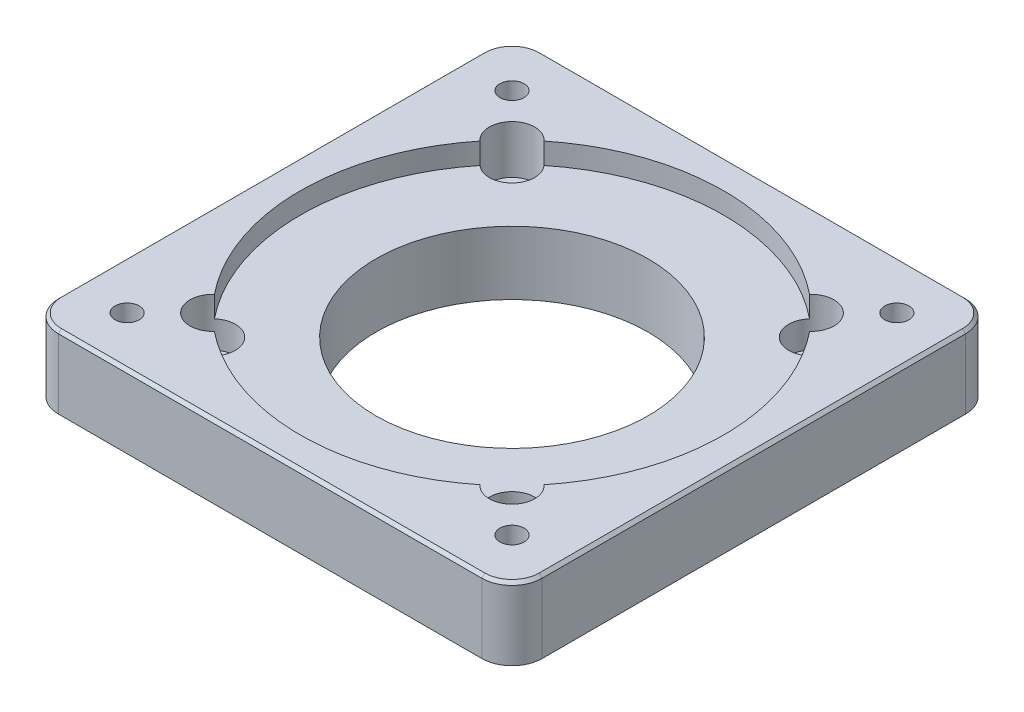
ISO-10303-21;
HEADER;
FILE_DESCRIPTION(('STEP AP214'),'2;1');
FILE_NAME('part.step','',(''),(''),'','','');
FILE_SCHEMA(('AUTOMOTIVE_DESIGN { 1 0 10303 214 1 1 1 1 }'));
ENDSEC;
DATA;
#1=APPLICATION_CONTEXT('core data for automotive mechanical design processes');
#2=APPLICATION_PROTOCOL_DEFINITION('international standard','automotive_design',2000,#1);
#3=PRODUCT_CONTEXT('',#1,'mechanical');
#4=PRODUCT('Part','Part','',(#3));
#5=PRODUCT_RELATED_PRODUCT_CATEGORY('part','',(#4));
#6=PRODUCT_DEFINITION_FORMATION('','',#4);
#7=PRODUCT_DEFINITION_CONTEXT('part definition',#1,'design');
#8=PRODUCT_DEFINITION('design','',#6,#7);
#9=PRODUCT_DEFINITION_SHAPE('','',#8);
#10=(LENGTH_UNIT() NAMED_UNIT(*) SI_UNIT(.MILLI.,.METRE.));
#11=(NAMED_UNIT(*) PLANE_ANGLE_UNIT() SI_UNIT($,.RADIAN.));
#12=(NAMED_UNIT(*) SI_UNIT($,.STERADIAN.) SOLID_ANGLE_UNIT());
#13=UNCERTAINTY_MEASURE_WITH_UNIT(LENGTH_MEASURE(1.E-05),#10,'distance_accuracy_value','');
#14=(GEOMETRIC_REPRESENTATION_CONTEXT(3) GLOBAL_UNCERTAINTY_ASSIGNED_CONTEXT((#13)) GLOBAL_UNIT_ASSIGNED_CONTEXT((#10,
#11,#12)) REPRESENTATION_CONTEXT('',''));
#15=CARTESIAN_POINT('',(0.,0.,0.));
#16=DIRECTION('',(0.,0.,1.));
#17=DIRECTION('',(1.,0.,0.));
#18=AXIS2_PLACEMENT_3D('',#15,#16,#17);
#19=CARTESIAN_POINT('',(0.,0.,0.));
#20=DIRECTION('',(0.,1.,0.));
#21=DIRECTION('',(0.,0.,1.));
#22=AXIS2_PLACEMENT_3D('',#19,#20,#21);
#23=PLANE('',#22);
#24=DIRECTION('',(0.,0.,-1.));
#25=VECTOR('',#24,1.);
#26=CARTESIAN_POINT('',(40.,0.,-40.));
#27=LINE('',#26,#25);
#28=CARTESIAN_POINT('',(40.,0.,35.));
#29=VERTEX_POINT('',#28);
#30=CARTESIAN_POINT('',(40.,0.,-35.));
#31=VERTEX_POINT('',#30);
#32=EDGE_CURVE('E541',#29,#31,#27,.T.);
#33=ORIENTED_EDGE('',*,*,#32,.F.);
#34=CARTESIAN_POINT('',(35.,0.,35.));
#35=DIRECTION('',(0.,1.,0.));
#36=DIRECTION('',(0.,0.,1.));
#37=AXIS2_PLACEMENT_3D('',#34,#35,#36);
#38=CIRCLE('',#37,5.);
#39=CARTESIAN_POINT('',(35.,0.,40.));
#40=VERTEX_POINT('',#39);
#41=EDGE_CURVE('E251',#29,#40,#38,.F.);
#42=ORIENTED_EDGE('',*,*,#41,.T.);
#43=DIRECTION('',(1.,0.,0.));
#44=VECTOR('',#43,1.);
#45=CARTESIAN_POINT('',(-40.,0.,40.));
#46=LINE('',#45,#44);
#47=CARTESIAN_POINT('',(-35.,0.,40.));
#48=VERTEX_POINT('',#47);
#49=EDGE_CURVE('E416',#48,#40,#46,.T.);
#50=ORIENTED_EDGE('',*,*,#49,.F.);
#51=CARTESIAN_POINT('',(-35.,0.,35.));
#52=DIRECTION('',(0.,1.,0.));
#53=DIRECTION('',(0.,0.,1.));
#54=AXIS2_PLACEMENT_3D('',#51,#52,#53);
#55=CIRCLE('',#54,5.);
#56=CARTESIAN_POINT('',(-40.,0.,35.));
#57=VERTEX_POINT('',#56);
#58=EDGE_CURVE('E245',#48,#57,#55,.F.);
#59=ORIENTED_EDGE('',*,*,#58,.T.);
#60=DIRECTION('',(0.,0.,1.));
#61=VECTOR('',#60,1.);
#62=CARTESIAN_POINT('',(-40.,0.,-40.));
#63=LINE('',#62,#61);
#64=CARTESIAN_POINT('',(-40.,0.,-35.));
#65=VERTEX_POINT('',#64);
#66=EDGE_CURVE('E411',#65,#57,#63,.T.);
#67=ORIENTED_EDGE('',*,*,#66,.F.);
#68=CARTESIAN_POINT('',(-35.,0.,-35.));
#69=DIRECTION('',(0.,1.,0.));
#70=DIRECTION('',(0.,0.,1.));
#71=AXIS2_PLACEMENT_3D('',#68,#69,#70);
#72=CIRCLE('',#71,5.);
#73=CARTESIAN_POINT('',(-35.,0.,-40.));
#74=VERTEX_POINT('',#73);
#75=EDGE_CURVE('E247',#65,#74,#72,.F.);
#76=ORIENTED_EDGE('',*,*,#75,.T.);
#77=DIRECTION('',(-1.,0.,0.));
#78=VECTOR('',#77,1.);
#79=CARTESIAN_POINT('',(-40.,0.,-40.));
#80=LINE('',#79,#78);
#81=CARTESIAN_POINT('',(35.,0.,-40.));
#82=VERTEX_POINT('',#81);
#83=EDGE_CURVE('E228',#82,#74,#80,.T.);
#84=ORIENTED_EDGE('',*,*,#83,.F.);
#85=CARTESIAN_POINT('',(35.,0.,-35.));
#86=DIRECTION('',(0.,1.,0.));
#87=DIRECTION('',(0.,0.,1.));
#88=AXIS2_PLACEMENT_3D('',#85,#86,#87);
#89=CIRCLE('',#88,5.);
#90=EDGE_CURVE('E249',#82,#31,#89,.F.);
#91=ORIENTED_EDGE('',*,*,#90,.T.);
#92=EDGE_LOOP('',(#33,#42,#50,#59,#67,#76,#84,#91));
#93=FACE_BOUND('',#92,.T.);
#94=CARTESIAN_POINT('',(24.7487373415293,0.,-24.748737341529));
#95=DIRECTION('',(0.,1.,0.));
#96=DIRECTION('',(0.,0.,1.));
#97=AXIS2_PLACEMENT_3D('',#94,#95,#96);
#98=CIRCLE('',#97,2.25);
#99=CARTESIAN_POINT('',(24.7487373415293,0.,-22.498737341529));
#100=VERTEX_POINT('',#99);
#101=EDGE_CURVE('E403',#100,#100,#98,.T.);
#102=ORIENTED_EDGE('',*,*,#101,.T.);
#103=EDGE_LOOP('',(#102));
#104=FACE_BOUND('',#103,.T.);
#105=CARTESIAN_POINT('',(24.7487373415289,0.,24.7487373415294));
#106=DIRECTION('',(0.,1.,0.));
#107=DIRECTION('',(0.,0.,1.));
#108=AXIS2_PLACEMENT_3D('',#105,#106,#107);
#109=CIRCLE('',#108,2.25);
#110=CARTESIAN_POINT('',(24.7487373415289,0.,26.9987373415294));
#111=VERTEX_POINT('',#110);
#112=EDGE_CURVE('E201',#111,#111,#109,.T.);
#113=ORIENTED_EDGE('',*,*,#112,.T.);
#114=EDGE_LOOP('',(#113));
#115=FACE_BOUND('',#114,.T.);
#116=CARTESIAN_POINT('',(-24.7487373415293,0.,24.748737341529));
#117=DIRECTION('',(0.,1.,0.));
#118=DIRECTION('',(0.,0.,1.));
#119=AXIS2_PLACEMENT_3D('',#116,#117,#118);
#120=CIRCLE('',#119,2.25);
#121=CARTESIAN_POINT('',(-24.7487373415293,0.,26.998737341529));
#122=VERTEX_POINT('',#121);
#123=EDGE_CURVE('E368',#122,#122,#120,.T.);
#124=ORIENTED_EDGE('',*,*,#123,.T.);
#125=EDGE_LOOP('',(#124));
#126=FACE_BOUND('',#125,.T.);
#127=CARTESIAN_POINT('',(-24.7487373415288,0.,-24.7487373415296));
#128=DIRECTION('',(0.,1.,0.));
#129=DIRECTION('',(0.,0.,1.));
#130=AXIS2_PLACEMENT_3D('',#127,#128,#129);
#131=CIRCLE('',#130,2.25);
#132=CARTESIAN_POINT('',(-24.7487373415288,0.,-22.4987373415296));
#133=VERTEX_POINT('',#132);
#134=EDGE_CURVE('E362',#133,#133,#131,.T.);
#135=ORIENTED_EDGE('',*,*,#134,.T.);
#136=EDGE_LOOP('',(#135));
#137=FACE_BOUND('',#136,.T.);
#138=CARTESIAN_POINT('',(-31.8198051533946,0.,-31.8198051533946));
#139=DIRECTION('',(0.,1.,0.));
#140=DIRECTION('',(0.,0.,1.));
#141=AXIS2_PLACEMENT_3D('',#138,#139,#140);
#142=CIRCLE('',#141,2.);
#143=CARTESIAN_POINT('',(-31.8198051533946,0.,-29.8198051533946));
#144=VERTEX_POINT('',#143);
#145=EDGE_CURVE('E354',#144,#144,#142,.T.);
#146=ORIENTED_EDGE('',*,*,#145,.T.);
#147=EDGE_LOOP('',(#146));
#148=FACE_BOUND('',#147,.T.);
#149=CARTESIAN_POINT('',(31.8198051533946,0.,-31.8198051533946));
#150=DIRECTION('',(0.,1.,0.));
#151=DIRECTION('',(0.,0.,1.));
#152=AXIS2_PLACEMENT_3D('',#149,#150,#151);
#153=CIRCLE('',#152,2.);
#154=CARTESIAN_POINT('',(31.8198051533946,0.,-29.8198051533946));
#155=VERTEX_POINT('',#154);
#156=EDGE_CURVE('E348',#155,#155,#153,.T.);
#157=ORIENTED_EDGE('',*,*,#156,.T.);
#158=EDGE_LOOP('',(#157));
#159=FACE_BOUND('',#158,.T.);
#160=CARTESIAN_POINT('',(31.8198051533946,0.,31.8198051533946));
#161=DIRECTION('',(0.,1.,0.));
#162=DIRECTION('',(0.,0.,1.));
#163=AXIS2_PLACEMENT_3D('',#160,#161,#162);
#164=CIRCLE('',#163,2.);
#165=CARTESIAN_POINT('',(31.8198051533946,0.,33.8198051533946));
#166=VERTEX_POINT('',#165);
#167=EDGE_CURVE('E342',#166,#166,#164,.T.);
#168=ORIENTED_EDGE('',*,*,#167,.T.);
#169=EDGE_LOOP('',(#168));
#170=FACE_BOUND('',#169,.T.);
#171=CARTESIAN_POINT('',(-31.8198051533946,0.,31.8198051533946));
#172=DIRECTION('',(0.,1.,0.));
#173=DIRECTION('',(0.,0.,1.));
#174=AXIS2_PLACEMENT_3D('',#171,#172,#173);
#175=CIRCLE('',#174,2.);
#176=CARTESIAN_POINT('',(-31.8198051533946,0.,33.8198051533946));
#177=VERTEX_POINT('',#176);
#178=EDGE_CURVE('E336',#177,#177,#175,.T.);
#179=ORIENTED_EDGE('',*,*,#178,.T.);
#180=EDGE_LOOP('',(#179));
#181=FACE_BOUND('',#180,.T.);
#182=CARTESIAN_POINT('',(0.,0.,0.));
#183=DIRECTION('',(0.,1.,0.));
#184=DIRECTION('',(0.,0.,1.));
#185=AXIS2_PLACEMENT_3D('',#182,#183,#184);
#186=CIRCLE('',#185,25.);
#187=CARTESIAN_POINT('',(0.,0.,25.));
#188=VERTEX_POINT('',#187);
#189=EDGE_CURVE('E267',#188,#188,#186,.F.);
#190=ORIENTED_EDGE('',*,*,#189,.F.);
#191=EDGE_LOOP('',(#190));
#192=FACE_BOUND('',#191,.T.);
#193=ADVANCED_FACE('F42',(#93,#104,#115,#126,#137,#148,#159,#170,#181,#192),#23,.F.);
#194=CARTESIAN_POINT('',(0.,8.5,0.));
#195=DIRECTION('',(0.,1.,0.));
#196=DIRECTION('',(0.,0.,1.));
#197=AXIS2_PLACEMENT_3D('',#194,#195,#196);
#198=CYLINDRICAL_SURFACE('',#197,35.);
#199=CARTESIAN_POINT('',(0.,8.5,0.));
#200=DIRECTION('',(0.,1.,0.));
#201=DIRECTION('',(0.,0.,1.));
#202=AXIS2_PLACEMENT_3D('',#199,#200,#201);
#203=CIRCLE('',#202,35.);
#204=CARTESIAN_POINT('',(-27.25452735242,8.5,-21.9588419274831));
#205=VERTEX_POINT('',#204);
#206=CARTESIAN_POINT('',(-27.2545273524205,8.5,21.9588419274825));
#207=VERTEX_POINT('',#206);
#208=EDGE_CURVE('E412',#205,#207,#203,.T.);
#209=ORIENTED_EDGE('',*,*,#208,.F.);
#210=DIRECTION('',(0.,1.,0.));
#211=VECTOR('',#210,1.);
#212=CARTESIAN_POINT('',(-27.25452735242,8.,-21.9588419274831));
#213=LINE('',#212,#211);
#214=CARTESIAN_POINT('',(-27.25452735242,12.,-21.9588419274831));
#215=VERTEX_POINT('',#214);
#216=EDGE_CURVE('E190',#205,#215,#213,.T.);
#217=ORIENTED_EDGE('',*,*,#216,.T.);
#218=CARTESIAN_POINT('',(0.,12.,0.));
#219=DIRECTION('',(0.,1.,0.));
#220=DIRECTION('',(0.,0.,1.));
#221=AXIS2_PLACEMENT_3D('',#218,#219,#220);
#222=CIRCLE('',#221,35.);
#223=CARTESIAN_POINT('',(-27.2545273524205,12.,21.9588419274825));
#224=VERTEX_POINT('',#223);
#225=EDGE_CURVE('E200',#215,#224,#222,.T.);
#226=ORIENTED_EDGE('',*,*,#225,.T.);
#227=DIRECTION('',(0.,1.,0.));
#228=VECTOR('',#227,1.);
#229=CARTESIAN_POINT('',(-27.2545273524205,8.,21.9588419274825));
#230=LINE('',#229,#228);
#231=EDGE_CURVE('E383',#224,#207,#230,.F.);
#232=ORIENTED_EDGE('',*,*,#231,.T.);
#233=EDGE_LOOP('',(#209,#217,#226,#232));
#234=FACE_BOUND('',#233,.T.);
#235=ADVANCED_FACE('F449',(#234),#198,.F.);
#236=CARTESIAN_POINT('',(-21.9588419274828,8.5,27.2545273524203));
#237=VERTEX_POINT('',#236);
#238=CARTESIAN_POINT('',(21.9588419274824,8.5,27.2545273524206));
#239=VERTEX_POINT('',#238);
#240=EDGE_CURVE('E209',#237,#239,#203,.T.);
#241=ORIENTED_EDGE('',*,*,#240,.F.);
#242=DIRECTION('',(0.,1.,0.));
#243=VECTOR('',#242,1.);
#244=CARTESIAN_POINT('',(-21.9588419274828,8.,27.2545273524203));
#245=LINE('',#244,#243);
#246=CARTESIAN_POINT('',(-21.9588419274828,12.,27.2545273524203));
#247=VERTEX_POINT('',#246);
#248=EDGE_CURVE('E387',#237,#247,#245,.T.);
#249=ORIENTED_EDGE('',*,*,#248,.T.);
#250=CARTESIAN_POINT('',(21.9588419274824,12.,27.2545273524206));
#251=VERTEX_POINT('',#250);
#252=EDGE_CURVE('E212',#247,#251,#222,.T.);
#253=ORIENTED_EDGE('',*,*,#252,.T.);
#254=DIRECTION('',(0.,1.,0.));
#255=VECTOR('',#254,1.);
#256=CARTESIAN_POINT('',(21.9588419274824,8.,27.2545273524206));
#257=LINE('',#256,#255);
#258=EDGE_CURVE('E394',#251,#239,#257,.F.);
#259=ORIENTED_EDGE('',*,*,#258,.T.);
#260=EDGE_LOOP('',(#241,#249,#253,#259));
#261=FACE_BOUND('',#260,.T.);
#262=ADVANCED_FACE('F429',(#261),#198,.F.);
#263=CARTESIAN_POINT('',(27.2545273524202,8.5,21.9588419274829));
#264=VERTEX_POINT('',#263);
#265=CARTESIAN_POINT('',(27.2545273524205,8.5,-21.9588419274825));
#266=VERTEX_POINT('',#265);
#267=EDGE_CURVE('E206',#264,#266,#203,.T.);
#268=ORIENTED_EDGE('',*,*,#267,.F.);
#269=DIRECTION('',(0.,1.,0.));
#270=VECTOR('',#269,1.);
#271=CARTESIAN_POINT('',(27.2545273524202,8.,21.9588419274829));
#272=LINE('',#271,#270);
#273=CARTESIAN_POINT('',(27.2545273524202,12.,21.9588419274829));
#274=VERTEX_POINT('',#273);
#275=EDGE_CURVE('E398',#264,#274,#272,.T.);
#276=ORIENTED_EDGE('',*,*,#275,.T.);
#277=CARTESIAN_POINT('',(27.2545273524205,12.,-21.9588419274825));
#278=VERTEX_POINT('',#277);
#279=EDGE_CURVE('E208',#274,#278,#222,.T.);
#280=ORIENTED_EDGE('',*,*,#279,.T.);
#281=DIRECTION('',(0.,1.,0.));
#282=VECTOR('',#281,1.);
#283=CARTESIAN_POINT('',(27.2545273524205,8.,-21.9588419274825));
#284=LINE('',#283,#282);
#285=EDGE_CURVE('E224',#278,#266,#284,.F.);
#286=ORIENTED_EDGE('',*,*,#285,.T.);
#287=EDGE_LOOP('',(#268,#276,#280,#286));
#288=FACE_BOUND('',#287,.T.);
#289=ADVANCED_FACE('F431',(#288),#198,.F.);
#290=CARTESIAN_POINT('',(-40.,12.,-40.));
#291=DIRECTION('',(1.,0.,0.));
#292=DIRECTION('',(0.,0.,-1.));
#293=AXIS2_PLACEMENT_3D('',#290,#291,#292);
#294=PLANE('',#293);
#295=DIRECTION('',(0.,-1.,0.));
#296=VECTOR('',#295,1.);
#297=CARTESIAN_POINT('',(-40.,12.,35.));
#298=LINE('',#297,#296);
#299=CARTESIAN_POINT('',(-40.,11.5,35.));
#300=VERTEX_POINT('',#299);
#301=EDGE_CURVE('E262',#57,#300,#298,.F.);
#302=ORIENTED_EDGE('',*,*,#301,.T.);
#303=DIRECTION('',(0.,0.,-1.));
#304=VECTOR('',#303,1.);
#305=CARTESIAN_POINT('',(-40.,11.5,-35.));
#306=LINE('',#305,#304);
#307=CARTESIAN_POINT('',(-40.,11.5,-35.));
#308=VERTEX_POINT('',#307);
#309=EDGE_CURVE('E294',#300,#308,#306,.T.);
#310=ORIENTED_EDGE('',*,*,#309,.T.);
#311=DIRECTION('',(0.,-1.,0.));
#312=VECTOR('',#311,1.);
#313=CARTESIAN_POINT('',(-40.,12.,-35.));
#314=LINE('',#313,#312);
#315=EDGE_CURVE('E265',#308,#65,#314,.T.);
#316=ORIENTED_EDGE('',*,*,#315,.T.);
#317=ORIENTED_EDGE('',*,*,#66,.T.);
#318=EDGE_LOOP('',(#302,#310,#316,#317));
#319=FACE_BOUND('',#318,.T.);
#320=ADVANCED_FACE('F472',(#319),#294,.F.);
#321=CARTESIAN_POINT('',(-40.,12.,40.));
#322=DIRECTION('',(0.,0.,-1.));
#323=DIRECTION('',(-1.,0.,0.));
#324=AXIS2_PLACEMENT_3D('',#321,#322,#323);
#325=PLANE('',#324);
#326=DIRECTION('',(0.,-1.,0.));
#327=VECTOR('',#326,1.);
#328=CARTESIAN_POINT('',(35.,12.,40.));
#329=LINE('',#328,#327);
#330=CARTESIAN_POINT('',(35.,11.5,40.));
#331=VERTEX_POINT('',#330);
#332=EDGE_CURVE('E255',#40,#331,#329,.F.);
#333=ORIENTED_EDGE('',*,*,#332,.T.);
#334=DIRECTION('',(-1.,0.,0.));
#335=VECTOR('',#334,1.);
#336=CARTESIAN_POINT('',(-35.,11.5,40.));
#337=LINE('',#336,#335);
#338=CARTESIAN_POINT('',(-35.,11.5,40.));
#339=VERTEX_POINT('',#338);
#340=EDGE_CURVE('E12',#331,#339,#337,.T.);
#341=ORIENTED_EDGE('',*,*,#340,.T.);
#342=DIRECTION('',(0.,-1.,0.));
#343=VECTOR('',#342,1.);
#344=CARTESIAN_POINT('',(-35.,12.,40.));
#345=LINE('',#344,#343);
#346=EDGE_CURVE('E253',#339,#48,#345,.T.);
#347=ORIENTED_EDGE('',*,*,#346,.T.);
#348=ORIENTED_EDGE('',*,*,#49,.T.);
#349=EDGE_LOOP('',(#333,#341,#347,#348));
#350=FACE_BOUND('',#349,.T.);
#351=ADVANCED_FACE('F468',(#350),#325,.F.);
#352=CARTESIAN_POINT('',(40.,12.,-40.));
#353=DIRECTION('',(-1.,0.,0.));
#354=DIRECTION('',(0.,0.,1.));
#355=AXIS2_PLACEMENT_3D('',#352,#353,#354);
#356=PLANE('',#355);
#357=DIRECTION('',(0.,-1.,0.));
#358=VECTOR('',#357,1.);
#359=CARTESIAN_POINT('',(40.,12.,-35.));
#360=LINE('',#359,#358);
#361=CARTESIAN_POINT('',(40.,11.5,-35.));
#362=VERTEX_POINT('',#361);
#363=EDGE_CURVE('E240',#31,#362,#360,.F.);
#364=ORIENTED_EDGE('',*,*,#363,.T.);
#365=DIRECTION('',(0.,0.,1.));
#366=VECTOR('',#365,1.);
#367=CARTESIAN_POINT('',(40.,11.5,35.));
#368=LINE('',#367,#366);
#369=CARTESIAN_POINT('',(40.,11.5,35.));
#370=VERTEX_POINT('',#369);
#371=EDGE_CURVE('E296',#362,#370,#368,.T.);
#372=ORIENTED_EDGE('',*,*,#371,.T.);
#373=DIRECTION('',(0.,-1.,0.));
#374=VECTOR('',#373,1.);
#375=CARTESIAN_POINT('',(40.,12.,35.));
#376=LINE('',#375,#374);
#377=EDGE_CURVE('E243',#370,#29,#376,.T.);
#378=ORIENTED_EDGE('',*,*,#377,.T.);
#379=ORIENTED_EDGE('',*,*,#32,.T.);
#380=EDGE_LOOP('',(#364,#372,#378,#379));
#381=FACE_BOUND('',#380,.T.);
#382=ADVANCED_FACE('F464',(#381),#356,.F.);
#383=CARTESIAN_POINT('',(-40.,12.,-40.));
#384=DIRECTION('',(0.,0.,1.));
#385=DIRECTION('',(1.,0.,0.));
#386=AXIS2_PLACEMENT_3D('',#383,#384,#385);
#387=PLANE('',#386);
#388=DIRECTION('',(0.,-1.,0.));
#389=VECTOR('',#388,1.);
#390=CARTESIAN_POINT('',(-35.,12.,-40.));
#391=LINE('',#390,#389);
#392=CARTESIAN_POINT('',(-35.,11.5,-40.));
#393=VERTEX_POINT('',#392);
#394=EDGE_CURVE('E257',#74,#393,#391,.F.);
#395=ORIENTED_EDGE('',*,*,#394,.T.);
#396=DIRECTION('',(1.,0.,0.));
#397=VECTOR('',#396,1.);
#398=CARTESIAN_POINT('',(35.,11.5,-40.));
#399=LINE('',#398,#397);
#400=CARTESIAN_POINT('',(35.,11.5,-40.));
#401=VERTEX_POINT('',#400);
#402=EDGE_CURVE('E287',#393,#401,#399,.T.);
#403=ORIENTED_EDGE('',*,*,#402,.T.);
#404=DIRECTION('',(0.,-1.,0.));
#405=VECTOR('',#404,1.);
#406=CARTESIAN_POINT('',(35.,12.,-40.));
#407=LINE('',#406,#405);
#408=EDGE_CURVE('E260',#401,#82,#407,.T.);
#409=ORIENTED_EDGE('',*,*,#408,.T.);
#410=ORIENTED_EDGE('',*,*,#83,.T.);
#411=EDGE_LOOP('',(#395,#403,#409,#410));
#412=FACE_BOUND('',#411,.T.);
#413=ADVANCED_FACE('F461',(#412),#387,.F.);
#414=CARTESIAN_POINT('',(0.,12.,0.));
#415=DIRECTION('',(0.,1.,0.));
#416=DIRECTION('',(0.,0.,1.));
#417=AXIS2_PLACEMENT_3D('',#414,#415,#416);
#418=PLANE('',#417);
#419=CARTESIAN_POINT('',(35.,12.,-35.));
#420=DIRECTION('',(0.,1.,0.));
#421=DIRECTION('',(0.,0.,1.));
#422=AXIS2_PLACEMENT_3D('',#419,#420,#421);
#423=CIRCLE('',#422,4.5);
#424=CARTESIAN_POINT('',(39.5,12.,-35.));
#425=VERTEX_POINT('',#424);
#426=CARTESIAN_POINT('',(35.,12.,-39.5));
#427=VERTEX_POINT('',#426);
#428=EDGE_CURVE('E280',#425,#427,#423,.T.);
#429=ORIENTED_EDGE('',*,*,#428,.T.);
#430=DIRECTION('',(-1.,0.,0.));
#431=VECTOR('',#430,1.);
#432=CARTESIAN_POINT('',(-35.,12.,-39.5));
#433=LINE('',#432,#431);
#434=CARTESIAN_POINT('',(-35.,12.,-39.5));
#435=VERTEX_POINT('',#434);
#436=EDGE_CURVE('E284',#427,#435,#433,.T.);
#437=ORIENTED_EDGE('',*,*,#436,.T.);
#438=CARTESIAN_POINT('',(-35.,12.,-35.));
#439=DIRECTION('',(0.,1.,0.));
#440=DIRECTION('',(0.,0.,1.));
#441=AXIS2_PLACEMENT_3D('',#438,#439,#440);
#442=CIRCLE('',#441,4.5);
#443=CARTESIAN_POINT('',(-39.5,12.,-35.));
#444=VERTEX_POINT('',#443);
#445=EDGE_CURVE('E282',#435,#444,#442,.T.);
#446=ORIENTED_EDGE('',*,*,#445,.T.);
#447=DIRECTION('',(0.,0.,1.));
#448=VECTOR('',#447,1.);
#449=CARTESIAN_POINT('',(-39.5,12.,35.));
#450=LINE('',#449,#448);
#451=CARTESIAN_POINT('',(-39.5,12.,35.));
#452=VERTEX_POINT('',#451);
#453=EDGE_CURVE('E278',#444,#452,#450,.T.);
#454=ORIENTED_EDGE('',*,*,#453,.T.);
#455=CARTESIAN_POINT('',(-35.,12.,35.));
#456=DIRECTION('',(0.,1.,0.));
#457=DIRECTION('',(0.,0.,1.));
#458=AXIS2_PLACEMENT_3D('',#455,#456,#457);
#459=CIRCLE('',#458,4.5);
#460=CARTESIAN_POINT('',(-35.,12.,39.5));
#461=VERTEX_POINT('',#460);
#462=EDGE_CURVE('E274',#452,#461,#459,.T.);
#463=ORIENTED_EDGE('',*,*,#462,.T.);
#464=DIRECTION('',(1.,0.,0.));
#465=VECTOR('',#464,1.);
#466=CARTESIAN_POINT('',(35.,12.,39.5));
#467=LINE('',#466,#465);
#468=CARTESIAN_POINT('',(35.,12.,39.5));
#469=VERTEX_POINT('',#468);
#470=EDGE_CURVE('E270',#461,#469,#467,.T.);
#471=ORIENTED_EDGE('',*,*,#470,.T.);
#472=CARTESIAN_POINT('',(35.,12.,35.));
#473=DIRECTION('',(0.,1.,0.));
#474=DIRECTION('',(0.,0.,1.));
#475=AXIS2_PLACEMENT_3D('',#472,#473,#474);
#476=CIRCLE('',#475,4.5);
#477=CARTESIAN_POINT('',(39.5,12.,35.));
#478=VERTEX_POINT('',#477);
#479=EDGE_CURVE('E272',#469,#478,#476,.T.);
#480=ORIENTED_EDGE('',*,*,#479,.T.);
#481=DIRECTION('',(0.,0.,-1.));
#482=VECTOR('',#481,1.);
#483=CARTESIAN_POINT('',(39.5,12.,-35.));
#484=LINE('',#483,#482);
#485=EDGE_CURVE('E276',#478,#425,#484,.T.);
#486=ORIENTED_EDGE('',*,*,#485,.T.);
#487=EDGE_LOOP('',(#429,#437,#446,#454,#463,#471,#480,#486));
#488=FACE_BOUND('',#487,.T.);
#489=CARTESIAN_POINT('',(-31.8198051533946,12.,31.8198051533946));
#490=DIRECTION('',(0.,1.,0.));
#491=DIRECTION('',(0.,0.,1.));
#492=AXIS2_PLACEMENT_3D('',#489,#490,#491);
#493=CIRCLE('',#492,2.);
#494=CARTESIAN_POINT('',(-31.8198051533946,12.,33.8198051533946));
#495=VERTEX_POINT('',#494);
#496=EDGE_CURVE('E333',#495,#495,#493,.T.);
#497=ORIENTED_EDGE('',*,*,#496,.F.);
#498=EDGE_LOOP('',(#497));
#499=FACE_BOUND('',#498,.T.);
#500=CARTESIAN_POINT('',(31.8198051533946,12.,31.8198051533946));
#501=DIRECTION('',(0.,1.,0.));
#502=DIRECTION('',(0.,0.,1.));
#503=AXIS2_PLACEMENT_3D('',#500,#501,#502);
#504=CIRCLE('',#503,2.);
#505=CARTESIAN_POINT('',(31.8198051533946,12.,33.8198051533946));
#506=VERTEX_POINT('',#505);
#507=EDGE_CURVE('E339',#506,#506,#504,.T.);
#508=ORIENTED_EDGE('',*,*,#507,.F.);
#509=EDGE_LOOP('',(#508));
#510=FACE_BOUND('',#509,.T.);
#511=CARTESIAN_POINT('',(31.8198051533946,12.,-31.8198051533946));
#512=DIRECTION('',(0.,1.,0.));
#513=DIRECTION('',(0.,0.,1.));
#514=AXIS2_PLACEMENT_3D('',#511,#512,#513);
#515=CIRCLE('',#514,2.);
#516=CARTESIAN_POINT('',(31.8198051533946,12.,-29.8198051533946));
#517=VERTEX_POINT('',#516);
#518=EDGE_CURVE('E345',#517,#517,#515,.T.);
#519=ORIENTED_EDGE('',*,*,#518,.F.);
#520=EDGE_LOOP('',(#519));
#521=FACE_BOUND('',#520,.T.);
#522=CARTESIAN_POINT('',(-31.8198051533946,12.,-31.8198051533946));
#523=DIRECTION('',(0.,1.,0.));
#524=DIRECTION('',(0.,0.,1.));
#525=AXIS2_PLACEMENT_3D('',#522,#523,#524);
#526=CIRCLE('',#525,2.);
#527=CARTESIAN_POINT('',(-31.8198051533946,12.,-29.8198051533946));
#528=VERTEX_POINT('',#527);
#529=EDGE_CURVE('E351',#528,#528,#526,.T.);
#530=ORIENTED_EDGE('',*,*,#529,.F.);
#531=EDGE_LOOP('',(#530));
#532=FACE_BOUND('',#531,.T.);
#533=CARTESIAN_POINT('',(-24.7487373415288,12.,-24.7487373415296));
#534=DIRECTION('',(0.,1.,0.));
#535=DIRECTION('',(1.,0.,0.));
#536=AXIS2_PLACEMENT_3D('',#533,#534,#535);
#537=CIRCLE('',#536,3.75);
#538=CARTESIAN_POINT('',(-21.9588419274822,12.,-27.2545273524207));
#539=VERTEX_POINT('',#538);
#540=EDGE_CURVE('E182',#539,#215,#537,.T.);
#541=ORIENTED_EDGE('',*,*,#540,.F.);
#542=CARTESIAN_POINT('',(21.9588419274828,12.,-27.2545273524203));
#543=VERTEX_POINT('',#542);
#544=EDGE_CURVE('E198',#543,#539,#222,.T.);
#545=ORIENTED_EDGE('',*,*,#544,.F.);
#546=CARTESIAN_POINT('',(24.7487373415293,12.,-24.748737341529));
#547=DIRECTION('',(0.,1.,0.));
#548=DIRECTION('',(0.,0.,1.));
#549=AXIS2_PLACEMENT_3D('',#546,#547,#548);
#550=CIRCLE('',#549,3.75);
#551=EDGE_CURVE('E406',#278,#543,#550,.T.);
#552=ORIENTED_EDGE('',*,*,#551,.F.);
#553=ORIENTED_EDGE('',*,*,#279,.F.);
#554=CARTESIAN_POINT('',(24.7487373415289,12.,24.7487373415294));
#555=DIRECTION('',(0.,1.,0.));
#556=DIRECTION('',(-1.,0.,0.));
#557=AXIS2_PLACEMENT_3D('',#554,#555,#556);
#558=CIRCLE('',#557,3.75);
#559=EDGE_CURVE('E390',#251,#274,#558,.T.);
#560=ORIENTED_EDGE('',*,*,#559,.F.);
#561=ORIENTED_EDGE('',*,*,#252,.F.);
#562=CARTESIAN_POINT('',(-24.7487373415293,12.,24.748737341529));
#563=DIRECTION('',(0.,1.,0.));
#564=DIRECTION('',(0.,0.,-1.));
#565=AXIS2_PLACEMENT_3D('',#562,#563,#564);
#566=CIRCLE('',#565,3.75);
#567=EDGE_CURVE('E379',#224,#247,#566,.T.);
#568=ORIENTED_EDGE('',*,*,#567,.F.);
#569=ORIENTED_EDGE('',*,*,#225,.F.);
#570=EDGE_LOOP('',(#541,#545,#552,#553,#560,#561,#568,#569));
#571=FACE_BOUND('',#570,.T.);
#572=ADVANCED_FACE('F196',(#488,#499,#510,#521,#532,#571),#418,.T.);
#573=ORIENTED_EDGE('',*,*,#544,.T.);
#574=DIRECTION('',(0.,1.,0.));
#575=VECTOR('',#574,1.);
#576=CARTESIAN_POINT('',(-21.9588419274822,8.,-27.2545273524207));
#577=LINE('',#576,#575);
#578=CARTESIAN_POINT('',(-21.9588419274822,8.5,-27.2545273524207));
#579=VERTEX_POINT('',#578);
#580=EDGE_CURVE('E179',#539,#579,#577,.F.);
#581=ORIENTED_EDGE('',*,*,#580,.T.);
#582=CARTESIAN_POINT('',(21.9588419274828,8.5,-27.2545273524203));
#583=VERTEX_POINT('',#582);
#584=EDGE_CURVE('E211',#583,#579,#203,.T.);
#585=ORIENTED_EDGE('',*,*,#584,.F.);
#586=DIRECTION('',(0.,1.,0.));
#587=VECTOR('',#586,1.);
#588=CARTESIAN_POINT('',(21.9588419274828,8.,-27.2545273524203));
#589=LINE('',#588,#587);
#590=EDGE_CURVE('E205',#583,#543,#589,.T.);
#591=ORIENTED_EDGE('',*,*,#590,.T.);
#592=EDGE_LOOP('',(#573,#581,#585,#591));
#593=FACE_BOUND('',#592,.T.);
#594=ADVANCED_FACE('F204',(#593),#198,.F.);
#595=CARTESIAN_POINT('',(0.,8.5,0.));
#596=DIRECTION('',(0.,1.,0.));
#597=DIRECTION('',(0.,0.,1.));
#598=AXIS2_PLACEMENT_3D('',#595,#596,#597);
#599=PLANE('',#598);
#600=CARTESIAN_POINT('',(-24.7487373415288,8.5,-24.7487373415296));
#601=DIRECTION('',(0.,1.,0.));
#602=DIRECTION('',(0.,0.,1.));
#603=AXIS2_PLACEMENT_3D('',#600,#601,#602);
#604=CIRCLE('',#603,3.75);
#605=EDGE_CURVE('E185',#205,#579,#604,.T.);
#606=ORIENTED_EDGE('',*,*,#605,.F.);
#607=ORIENTED_EDGE('',*,*,#208,.T.);
#608=CARTESIAN_POINT('',(-24.7487373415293,8.5,24.748737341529));
#609=DIRECTION('',(0.,1.,0.));
#610=DIRECTION('',(0.,0.,1.));
#611=AXIS2_PLACEMENT_3D('',#608,#609,#610);
#612=CIRCLE('',#611,3.75);
#613=EDGE_CURVE('E236',#237,#207,#612,.T.);
#614=ORIENTED_EDGE('',*,*,#613,.F.);
#615=ORIENTED_EDGE('',*,*,#240,.T.);
#616=CARTESIAN_POINT('',(24.7487373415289,8.5,24.7487373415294));
#617=DIRECTION('',(0.,1.,0.));
#618=DIRECTION('',(0.,0.,1.));
#619=AXIS2_PLACEMENT_3D('',#616,#617,#618);
#620=CIRCLE('',#619,3.75);
#621=EDGE_CURVE('E233',#264,#239,#620,.T.);
#622=ORIENTED_EDGE('',*,*,#621,.F.);
#623=ORIENTED_EDGE('',*,*,#267,.T.);
#624=CARTESIAN_POINT('',(24.7487373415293,8.5,-24.748737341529));
#625=DIRECTION('',(0.,1.,0.));
#626=DIRECTION('',(0.,0.,1.));
#627=AXIS2_PLACEMENT_3D('',#624,#625,#626);
#628=CIRCLE('',#627,3.75);
#629=EDGE_CURVE('E230',#583,#266,#628,.T.);
#630=ORIENTED_EDGE('',*,*,#629,.F.);
#631=ORIENTED_EDGE('',*,*,#584,.T.);
#632=EDGE_LOOP('',(#606,#607,#614,#615,#622,#623,#630,#631));
#633=FACE_BOUND('',#632,.T.);
#634=CARTESIAN_POINT('',(0.,8.5,0.));
#635=DIRECTION('',(0.,1.,0.));
#636=DIRECTION('',(0.,0.,1.));
#637=AXIS2_PLACEMENT_3D('',#634,#635,#636);
#638=CIRCLE('',#637,22.5);
#639=CARTESIAN_POINT('',(0.,8.5,22.5));
#640=VERTEX_POINT('',#639);
#641=EDGE_CURVE('E214',#640,#640,#638,.T.);
#642=ORIENTED_EDGE('',*,*,#641,.F.);
#643=EDGE_LOOP('',(#642));
#644=FACE_BOUND('',#643,.T.);
#645=ADVANCED_FACE('F421',(#633,#644),#599,.T.);
#646=CARTESIAN_POINT('',(0.,48.,0.));
#647=DIRECTION('',(0.,-1.,0.));
#648=DIRECTION('',(0.,0.,-1.));
#649=AXIS2_PLACEMENT_3D('',#646,#647,#648);
#650=CYLINDRICAL_SURFACE('',#649,22.5);
#651=ORIENTED_EDGE('',*,*,#641,.T.);
#652=EDGE_LOOP('',(#651));
#653=FACE_BOUND('',#652,.T.);
#654=CARTESIAN_POINT('',(0.,-2.,0.));
#655=DIRECTION('',(0.,-1.,0.));
#656=DIRECTION('',(0.,0.,-1.));
#657=AXIS2_PLACEMENT_3D('',#654,#655,#656);
#658=CIRCLE('',#657,22.5);
#659=CARTESIAN_POINT('',(0.,-2.,-22.5));
#660=VERTEX_POINT('',#659);
#661=EDGE_CURVE('E323',#660,#660,#658,.T.);
#662=ORIENTED_EDGE('',*,*,#661,.T.);
#663=EDGE_LOOP('',(#662));
#664=FACE_BOUND('',#663,.T.);
#665=ADVANCED_FACE('F436',(#653,#664),#650,.F.);
#666=CARTESIAN_POINT('',(24.7487373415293,4.,-24.748737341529));
#667=DIRECTION('',(0.,1.,0.));
#668=DIRECTION('',(0.,0.,1.));
#669=AXIS2_PLACEMENT_3D('',#666,#667,#668);
#670=CYLINDRICAL_SURFACE('',#669,3.75);
#671=CARTESIAN_POINT('',(24.7487373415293,4.,-24.748737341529));
#672=DIRECTION('',(0.,1.,0.));
#673=DIRECTION('',(0.,0.,1.));
#674=AXIS2_PLACEMENT_3D('',#671,#672,#673);
#675=CIRCLE('',#674,3.75);
#676=CARTESIAN_POINT('',(24.7487373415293,4.,-20.998737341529));
#677=VERTEX_POINT('',#676);
#678=EDGE_CURVE('E407',#677,#677,#675,.T.);
#679=ORIENTED_EDGE('',*,*,#678,.F.);
#680=EDGE_LOOP('',(#679));
#681=FACE_BOUND('',#680,.T.);
#682=ORIENTED_EDGE('',*,*,#629,.T.);
#683=ORIENTED_EDGE('',*,*,#285,.F.);
#684=ORIENTED_EDGE('',*,*,#551,.T.);
#685=ORIENTED_EDGE('',*,*,#590,.F.);
#686=EDGE_LOOP('',(#682,#683,#684,#685));
#687=FACE_BOUND('',#686,.T.);
#688=ADVANCED_FACE('F433',(#681,#687),#670,.F.);
#689=CARTESIAN_POINT('',(24.7487373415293,4.,-24.748737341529));
#690=DIRECTION('',(0.,1.,0.));
#691=DIRECTION('',(0.,0.,1.));
#692=AXIS2_PLACEMENT_3D('',#689,#690,#691);
#693=PLANE('',#692);
#694=CARTESIAN_POINT('',(24.7487373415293,4.,-24.748737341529));
#695=DIRECTION('',(0.,1.,0.));
#696=DIRECTION('',(0.,0.,1.));
#697=AXIS2_PLACEMENT_3D('',#694,#695,#696);
#698=CIRCLE('',#697,2.25);
#699=CARTESIAN_POINT('',(24.7487373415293,4.,-22.498737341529));
#700=VERTEX_POINT('',#699);
#701=EDGE_CURVE('E400',#700,#700,#698,.T.);
#702=ORIENTED_EDGE('',*,*,#701,.F.);
#703=EDGE_LOOP('',(#702));
#704=FACE_BOUND('',#703,.T.);
#705=ORIENTED_EDGE('',*,*,#678,.T.);
#706=EDGE_LOOP('',(#705));
#707=FACE_BOUND('',#706,.T.);
#708=ADVANCED_FACE('F435',(#704,#707),#693,.T.);
#709=CARTESIAN_POINT('',(24.7487373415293,-8.,-24.748737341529));
#710=DIRECTION('',(0.,1.,0.));
#711=DIRECTION('',(0.,0.,1.));
#712=AXIS2_PLACEMENT_3D('',#709,#710,#711);
#713=CYLINDRICAL_SURFACE('',#712,2.25);
#714=ORIENTED_EDGE('',*,*,#701,.T.);
#715=EDGE_LOOP('',(#714));
#716=FACE_BOUND('',#715,.T.);
#717=ORIENTED_EDGE('',*,*,#101,.F.);
#718=EDGE_LOOP('',(#717));
#719=FACE_BOUND('',#718,.T.);
#720=ADVANCED_FACE('F443',(#716,#719),#713,.F.);
#721=CARTESIAN_POINT('',(24.7487373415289,4.,24.7487373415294));
#722=DIRECTION('',(0.,1.,0.));
#723=DIRECTION('',(0.,0.,1.));
#724=AXIS2_PLACEMENT_3D('',#721,#722,#723);
#725=CYLINDRICAL_SURFACE('',#724,3.75);
#726=CARTESIAN_POINT('',(24.7487373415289,4.,24.7487373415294));
#727=DIRECTION('',(0.,1.,0.));
#728=DIRECTION('',(-1.,0.,0.));
#729=AXIS2_PLACEMENT_3D('',#726,#727,#728);
#730=CIRCLE('',#729,3.75);
#731=CARTESIAN_POINT('',(20.9987373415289,4.,24.7487373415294));
#732=VERTEX_POINT('',#731);
#733=EDGE_CURVE('E391',#732,#732,#730,.T.);
#734=ORIENTED_EDGE('',*,*,#733,.F.);
#735=EDGE_LOOP('',(#734));
#736=FACE_BOUND('',#735,.T.);
#737=ORIENTED_EDGE('',*,*,#621,.T.);
#738=ORIENTED_EDGE('',*,*,#258,.F.);
#739=ORIENTED_EDGE('',*,*,#559,.T.);
#740=ORIENTED_EDGE('',*,*,#275,.F.);
#741=EDGE_LOOP('',(#737,#738,#739,#740));
#742=FACE_BOUND('',#741,.T.);
#743=ADVANCED_FACE('F427',(#736,#742),#725,.F.);
#744=CARTESIAN_POINT('',(24.7487373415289,4.,24.7487373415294));
#745=DIRECTION('',(0.,1.,0.));
#746=DIRECTION('',(-1.,0.,0.));
#747=AXIS2_PLACEMENT_3D('',#744,#745,#746);
#748=PLANE('',#747);
#749=CARTESIAN_POINT('',(24.7487373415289,4.,24.7487373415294));
#750=DIRECTION('',(0.,1.,0.));
#751=DIRECTION('',(-1.,0.,0.));
#752=AXIS2_PLACEMENT_3D('',#749,#750,#751);
#753=CIRCLE('',#752,2.25);
#754=CARTESIAN_POINT('',(22.4987373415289,4.,24.7487373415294));
#755=VERTEX_POINT('',#754);
#756=EDGE_CURVE('E371',#755,#755,#753,.T.);
#757=ORIENTED_EDGE('',*,*,#756,.F.);
#758=EDGE_LOOP('',(#757));
#759=FACE_BOUND('',#758,.T.);
#760=ORIENTED_EDGE('',*,*,#733,.T.);
#761=EDGE_LOOP('',(#760));
#762=FACE_BOUND('',#761,.T.);
#763=ADVANCED_FACE('F611',(#759,#762),#748,.T.);
#764=CARTESIAN_POINT('',(-24.7487373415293,4.,24.748737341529));
#765=DIRECTION('',(0.,1.,0.));
#766=DIRECTION('',(0.,0.,1.));
#767=AXIS2_PLACEMENT_3D('',#764,#765,#766);
#768=CYLINDRICAL_SURFACE('',#767,3.75);
#769=CARTESIAN_POINT('',(-24.7487373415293,4.,24.748737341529));
#770=DIRECTION('',(0.,1.,0.));
#771=DIRECTION('',(0.,0.,-1.));
#772=AXIS2_PLACEMENT_3D('',#769,#770,#771);
#773=CIRCLE('',#772,3.75);
#774=CARTESIAN_POINT('',(-24.7487373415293,4.,20.998737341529));
#775=VERTEX_POINT('',#774);
#776=EDGE_CURVE('E380',#775,#775,#773,.T.);
#777=ORIENTED_EDGE('',*,*,#776,.F.);
#778=EDGE_LOOP('',(#777));
#779=FACE_BOUND('',#778,.T.);
#780=ORIENTED_EDGE('',*,*,#613,.T.);
#781=ORIENTED_EDGE('',*,*,#231,.F.);
#782=ORIENTED_EDGE('',*,*,#567,.T.);
#783=ORIENTED_EDGE('',*,*,#248,.F.);
#784=EDGE_LOOP('',(#780,#781,#782,#783));
#785=FACE_BOUND('',#784,.T.);
#786=ADVANCED_FACE('F607',(#779,#785),#768,.F.);
#787=CARTESIAN_POINT('',(-24.7487373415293,4.,24.748737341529));
#788=DIRECTION('',(0.,1.,0.));
#789=DIRECTION('',(0.,0.,-1.));
#790=AXIS2_PLACEMENT_3D('',#787,#788,#789);
#791=PLANE('',#790);
#792=CARTESIAN_POINT('',(-24.7487373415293,4.,24.748737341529));
#793=DIRECTION('',(0.,1.,0.));
#794=DIRECTION('',(0.,0.,-1.));
#795=AXIS2_PLACEMENT_3D('',#792,#793,#794);
#796=CIRCLE('',#795,2.25);
#797=CARTESIAN_POINT('',(-24.7487373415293,4.,22.498737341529));
#798=VERTEX_POINT('',#797);
#799=EDGE_CURVE('E365',#798,#798,#796,.T.);
#800=ORIENTED_EDGE('',*,*,#799,.F.);
#801=EDGE_LOOP('',(#800));
#802=FACE_BOUND('',#801,.T.);
#803=ORIENTED_EDGE('',*,*,#776,.T.);
#804=EDGE_LOOP('',(#803));
#805=FACE_BOUND('',#804,.T.);
#806=ADVANCED_FACE('F603',(#802,#805),#791,.T.);
#807=CARTESIAN_POINT('',(-24.7487373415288,4.,-24.7487373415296));
#808=DIRECTION('',(0.,1.,0.));
#809=DIRECTION('',(0.,0.,1.));
#810=AXIS2_PLACEMENT_3D('',#807,#808,#809);
#811=CYLINDRICAL_SURFACE('',#810,3.75);
#812=CARTESIAN_POINT('',(-24.7487373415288,4.,-24.7487373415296));
#813=DIRECTION('',(0.,1.,0.));
#814=DIRECTION('',(1.,0.,0.));
#815=AXIS2_PLACEMENT_3D('',#812,#813,#814);
#816=CIRCLE('',#815,3.75);
#817=CARTESIAN_POINT('',(-20.9987373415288,4.,-24.7487373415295));
#818=VERTEX_POINT('',#817);
#819=EDGE_CURVE('E191',#818,#818,#816,.T.);
#820=ORIENTED_EDGE('',*,*,#819,.F.);
#821=EDGE_LOOP('',(#820));
#822=FACE_BOUND('',#821,.T.);
#823=ORIENTED_EDGE('',*,*,#605,.T.);
#824=ORIENTED_EDGE('',*,*,#580,.F.);
#825=ORIENTED_EDGE('',*,*,#540,.T.);
#826=ORIENTED_EDGE('',*,*,#216,.F.);
#827=EDGE_LOOP('',(#823,#824,#825,#826));
#828=FACE_BOUND('',#827,.T.);
#829=ADVANCED_FACE('F181',(#822,#828),#811,.F.);
#830=CARTESIAN_POINT('',(-24.7487373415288,4.,-24.7487373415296));
#831=DIRECTION('',(0.,1.,0.));
#832=DIRECTION('',(1.,0.,0.));
#833=AXIS2_PLACEMENT_3D('',#830,#831,#832);
#834=PLANE('',#833);
#835=CARTESIAN_POINT('',(-24.7487373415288,4.,-24.7487373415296));
#836=DIRECTION('',(0.,1.,0.));
#837=DIRECTION('',(1.,0.,0.));
#838=AXIS2_PLACEMENT_3D('',#835,#836,#837);
#839=CIRCLE('',#838,2.25);
#840=CARTESIAN_POINT('',(-22.4987373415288,4.,-24.7487373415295));
#841=VERTEX_POINT('',#840);
#842=EDGE_CURVE('E357',#841,#841,#839,.T.);
#843=ORIENTED_EDGE('',*,*,#842,.F.);
#844=EDGE_LOOP('',(#843));
#845=FACE_BOUND('',#844,.T.);
#846=ORIENTED_EDGE('',*,*,#819,.T.);
#847=EDGE_LOOP('',(#846));
#848=FACE_BOUND('',#847,.T.);
#849=ADVANCED_FACE('F596',(#845,#848),#834,.T.);
#850=CARTESIAN_POINT('',(24.7487373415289,-8.,24.7487373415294));
#851=DIRECTION('',(0.,1.,0.));
#852=DIRECTION('',(0.,0.,1.));
#853=AXIS2_PLACEMENT_3D('',#850,#851,#852);
#854=CYLINDRICAL_SURFACE('',#853,2.25);
#855=ORIENTED_EDGE('',*,*,#756,.T.);
#856=EDGE_LOOP('',(#855));
#857=FACE_BOUND('',#856,.T.);
#858=ORIENTED_EDGE('',*,*,#112,.F.);
#859=EDGE_LOOP('',(#858));
#860=FACE_BOUND('',#859,.T.);
#861=ADVANCED_FACE('F592',(#857,#860),#854,.F.);
#862=CARTESIAN_POINT('',(-24.7487373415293,-8.,24.748737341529));
#863=DIRECTION('',(0.,1.,0.));
#864=DIRECTION('',(0.,0.,1.));
#865=AXIS2_PLACEMENT_3D('',#862,#863,#864);
#866=CYLINDRICAL_SURFACE('',#865,2.25);
#867=ORIENTED_EDGE('',*,*,#799,.T.);
#868=EDGE_LOOP('',(#867));
#869=FACE_BOUND('',#868,.T.);
#870=ORIENTED_EDGE('',*,*,#123,.F.);
#871=EDGE_LOOP('',(#870));
#872=FACE_BOUND('',#871,.T.);
#873=ADVANCED_FACE('F588',(#869,#872),#866,.F.);
#874=CARTESIAN_POINT('',(-24.7487373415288,-8.,-24.7487373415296));
#875=DIRECTION('',(0.,1.,0.));
#876=DIRECTION('',(0.,0.,1.));
#877=AXIS2_PLACEMENT_3D('',#874,#875,#876);
#878=CYLINDRICAL_SURFACE('',#877,2.25);
#879=ORIENTED_EDGE('',*,*,#842,.T.);
#880=EDGE_LOOP('',(#879));
#881=FACE_BOUND('',#880,.T.);
#882=ORIENTED_EDGE('',*,*,#134,.F.);
#883=EDGE_LOOP('',(#882));
#884=FACE_BOUND('',#883,.T.);
#885=ADVANCED_FACE('F480',(#881,#884),#878,.F.);
#886=CARTESIAN_POINT('',(35.,12.,35.));
#887=DIRECTION('',(0.,-1.,0.));
#888=DIRECTION('',(0.,0.,-1.));
#889=AXIS2_PLACEMENT_3D('',#886,#887,#888);
#890=CYLINDRICAL_SURFACE('',#889,5.);
#891=ORIENTED_EDGE('',*,*,#377,.F.);
#892=CARTESIAN_POINT('',(35.,11.5,35.));
#893=DIRECTION('',(0.,1.,0.));
#894=DIRECTION('',(0.,0.,1.));
#895=AXIS2_PLACEMENT_3D('',#892,#893,#894);
#896=CIRCLE('',#895,5.);
#897=EDGE_CURVE('E51',#370,#331,#896,.F.);
#898=ORIENTED_EDGE('',*,*,#897,.T.);
#899=ORIENTED_EDGE('',*,*,#332,.F.);
#900=ORIENTED_EDGE('',*,*,#41,.F.);
#901=EDGE_LOOP('',(#891,#898,#899,#900));
#902=FACE_BOUND('',#901,.T.);
#903=ADVANCED_FACE('F476',(#902),#890,.T.);
#904=CARTESIAN_POINT('',(35.,12.,-35.));
#905=DIRECTION('',(0.,-1.,0.));
#906=DIRECTION('',(0.,0.,-1.));
#907=AXIS2_PLACEMENT_3D('',#904,#905,#906);
#908=CYLINDRICAL_SURFACE('',#907,5.);
#909=ORIENTED_EDGE('',*,*,#408,.F.);
#910=CARTESIAN_POINT('',(35.,11.5,-35.));
#911=DIRECTION('',(0.,1.,0.));
#912=DIRECTION('',(0.,0.,1.));
#913=AXIS2_PLACEMENT_3D('',#910,#911,#912);
#914=CIRCLE('',#913,5.);
#915=EDGE_CURVE('E292',#401,#362,#914,.F.);
#916=ORIENTED_EDGE('',*,*,#915,.T.);
#917=ORIENTED_EDGE('',*,*,#363,.F.);
#918=ORIENTED_EDGE('',*,*,#90,.F.);
#919=EDGE_LOOP('',(#909,#916,#917,#918));
#920=FACE_BOUND('',#919,.T.);
#921=ADVANCED_FACE('F479',(#920),#908,.T.);
#922=CARTESIAN_POINT('',(-35.,12.,-35.));
#923=DIRECTION('',(0.,-1.,0.));
#924=DIRECTION('',(0.,0.,-1.));
#925=AXIS2_PLACEMENT_3D('',#922,#923,#924);
#926=CYLINDRICAL_SURFACE('',#925,5.);
#927=ORIENTED_EDGE('',*,*,#315,.F.);
#928=CARTESIAN_POINT('',(-35.,11.5,-35.));
#929=DIRECTION('',(0.,1.,0.));
#930=DIRECTION('',(0.,0.,1.));
#931=AXIS2_PLACEMENT_3D('',#928,#929,#930);
#932=CIRCLE('',#931,5.);
#933=EDGE_CURVE('E290',#308,#393,#932,.F.);
#934=ORIENTED_EDGE('',*,*,#933,.T.);
#935=ORIENTED_EDGE('',*,*,#394,.F.);
#936=ORIENTED_EDGE('',*,*,#75,.F.);
#937=EDGE_LOOP('',(#927,#934,#935,#936));
#938=FACE_BOUND('',#937,.T.);
#939=ADVANCED_FACE('F483',(#938),#926,.T.);
#940=CARTESIAN_POINT('',(-35.,12.,35.));
#941=DIRECTION('',(0.,-1.,0.));
#942=DIRECTION('',(0.,0.,-1.));
#943=AXIS2_PLACEMENT_3D('',#940,#941,#942);
#944=CYLINDRICAL_SURFACE('',#943,5.);
#945=ORIENTED_EDGE('',*,*,#346,.F.);
#946=CARTESIAN_POINT('',(-35.,11.5,35.));
#947=DIRECTION('',(0.,1.,0.));
#948=DIRECTION('',(0.,0.,1.));
#949=AXIS2_PLACEMENT_3D('',#946,#947,#948);
#950=CIRCLE('',#949,5.);
#951=EDGE_CURVE('E298',#339,#300,#950,.F.);
#952=ORIENTED_EDGE('',*,*,#951,.T.);
#953=ORIENTED_EDGE('',*,*,#301,.F.);
#954=ORIENTED_EDGE('',*,*,#58,.F.);
#955=EDGE_LOOP('',(#945,#952,#953,#954));
#956=FACE_BOUND('',#955,.T.);
#957=ADVANCED_FACE('F487',(#956),#944,.T.);
#958=CARTESIAN_POINT('',(-31.8198051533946,0.,-31.8198051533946));
#959=DIRECTION('',(0.,1.,0.));
#960=DIRECTION('',(0.,0.,1.));
#961=AXIS2_PLACEMENT_3D('',#958,#959,#960);
#962=CYLINDRICAL_SURFACE('',#961,2.);
#963=ORIENTED_EDGE('',*,*,#145,.F.);
#964=EDGE_LOOP('',(#963));
#965=FACE_BOUND('',#964,.T.);
#966=ORIENTED_EDGE('',*,*,#529,.T.);
#967=EDGE_LOOP('',(#966));
#968=FACE_BOUND('',#967,.T.);
#969=ADVANCED_FACE('F491',(#965,#968),#962,.F.);
#970=CARTESIAN_POINT('',(31.8198051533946,0.,-31.8198051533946));
#971=DIRECTION('',(0.,1.,0.));
#972=DIRECTION('',(0.,0.,1.));
#973=AXIS2_PLACEMENT_3D('',#970,#971,#972);
#974=CYLINDRICAL_SURFACE('',#973,2.);
#975=ORIENTED_EDGE('',*,*,#156,.F.);
#976=EDGE_LOOP('',(#975));
#977=FACE_BOUND('',#976,.T.);
#978=ORIENTED_EDGE('',*,*,#518,.T.);
#979=EDGE_LOOP('',(#978));
#980=FACE_BOUND('',#979,.T.);
#981=ADVANCED_FACE('F574',(#977,#980),#974,.F.);
#982=CARTESIAN_POINT('',(31.8198051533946,0.,31.8198051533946));
#983=DIRECTION('',(0.,1.,0.));
#984=DIRECTION('',(0.,0.,1.));
#985=AXIS2_PLACEMENT_3D('',#982,#983,#984);
#986=CYLINDRICAL_SURFACE('',#985,2.);
#987=ORIENTED_EDGE('',*,*,#167,.F.);
#988=EDGE_LOOP('',(#987));
#989=FACE_BOUND('',#988,.T.);
#990=ORIENTED_EDGE('',*,*,#507,.T.);
#991=EDGE_LOOP('',(#990));
#992=FACE_BOUND('',#991,.T.);
#993=ADVANCED_FACE('F580',(#989,#992),#986,.F.);
#994=CARTESIAN_POINT('',(-31.8198051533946,0.,31.8198051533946));
#995=DIRECTION('',(0.,1.,0.));
#996=DIRECTION('',(0.,0.,1.));
#997=AXIS2_PLACEMENT_3D('',#994,#995,#996);
#998=CYLINDRICAL_SURFACE('',#997,2.);
#999=ORIENTED_EDGE('',*,*,#178,.F.);
#1000=EDGE_LOOP('',(#999));
#1001=FACE_BOUND('',#1000,.T.);
#1002=ORIENTED_EDGE('',*,*,#496,.T.);
#1003=EDGE_LOOP('',(#1002));
#1004=FACE_BOUND('',#1003,.T.);
#1005=ADVANCED_FACE('F643',(#1001,#1004),#998,.F.);
#1006=CARTESIAN_POINT('',(0.,-2.,0.));
#1007=DIRECTION('',(0.,-1.,0.));
#1008=DIRECTION('',(0.,0.,-1.));
#1009=AXIS2_PLACEMENT_3D('',#1006,#1007,#1008);
#1010=PLANE('',#1009);
#1011=CARTESIAN_POINT('',(0.,-2.,0.));
#1012=DIRECTION('',(0.,-1.,0.));
#1013=DIRECTION('',(1.,0.,0.));
#1014=AXIS2_PLACEMENT_3D('',#1011,#1012,#1013);
#1015=CIRCLE('',#1014,25.);
#1016=CARTESIAN_POINT('',(25.,-2.,0.));
#1017=VERTEX_POINT('',#1016);
#1018=EDGE_CURVE('E328',#1017,#1017,#1015,.T.);
#1019=ORIENTED_EDGE('',*,*,#1018,.T.);
#1020=EDGE_LOOP('',(#1019));
#1021=FACE_BOUND('',#1020,.T.);
#1022=ORIENTED_EDGE('',*,*,#661,.F.);
#1023=EDGE_LOOP('',(#1022));
#1024=FACE_BOUND('',#1023,.T.);
#1025=ADVANCED_FACE('F525',(#1021,#1024),#1010,.T.);
#1026=CARTESIAN_POINT('',(0.,-2.,0.));
#1027=DIRECTION('',(0.,1.,0.));
#1028=DIRECTION('',(0.,0.,1.));
#1029=AXIS2_PLACEMENT_3D('',#1026,#1027,#1028);
#1030=CYLINDRICAL_SURFACE('',#1029,25.);
#1031=ORIENTED_EDGE('',*,*,#1018,.F.);
#1032=EDGE_LOOP('',(#1031));
#1033=FACE_BOUND('',#1032,.T.);
#1034=ORIENTED_EDGE('',*,*,#189,.T.);
#1035=EDGE_LOOP('',(#1034));
#1036=FACE_BOUND('',#1035,.T.);
#1037=ADVANCED_FACE('F520',(#1033,#1036),#1030,.T.);
#1038=CARTESIAN_POINT('',(0.,12.,39.5));
#1039=DIRECTION('',(0.,0.707106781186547,0.707106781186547));
#1040=DIRECTION('',(-1.,0.,0.));
#1041=AXIS2_PLACEMENT_3D('',#1038,#1039,#1040);
#1042=PLANE('',#1041);
#1043=DIRECTION('',(0.,0.707106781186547,-0.707106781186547));
#1044=VECTOR('',#1043,1.);
#1045=CARTESIAN_POINT('',(-35.,11.5,40.));
#1046=LINE('',#1045,#1044);
#1047=EDGE_CURVE('E316',#339,#461,#1046,.T.);
#1048=ORIENTED_EDGE('',*,*,#1047,.F.);
#1049=ORIENTED_EDGE('',*,*,#340,.F.);
#1050=DIRECTION('',(0.,-0.707106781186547,0.707106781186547));
#1051=VECTOR('',#1050,1.);
#1052=CARTESIAN_POINT('',(35.,12.,39.5));
#1053=LINE('',#1052,#1051);
#1054=EDGE_CURVE('E46',#469,#331,#1053,.T.);
#1055=ORIENTED_EDGE('',*,*,#1054,.F.);
#1056=ORIENTED_EDGE('',*,*,#470,.F.);
#1057=EDGE_LOOP('',(#1048,#1049,#1055,#1056));
#1058=FACE_BOUND('',#1057,.T.);
#1059=ADVANCED_FACE('F44',(#1058),#1042,.T.);
#1060=CARTESIAN_POINT('',(35.,12.,35.));
#1061=DIRECTION('',(0.,-1.,0.));
#1062=DIRECTION('',(0.,0.,-1.));
#1063=AXIS2_PLACEMENT_3D('',#1060,#1061,#1062);
#1064=CONICAL_SURFACE('',#1063,4.5,0.785398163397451);
#1065=ORIENTED_EDGE('',*,*,#1054,.T.);
#1066=ORIENTED_EDGE('',*,*,#897,.F.);
#1067=DIRECTION('',(0.707106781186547,-0.707106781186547,0.));
#1068=VECTOR('',#1067,1.);
#1069=CARTESIAN_POINT('',(39.5,12.,35.));
#1070=LINE('',#1069,#1068);
#1071=EDGE_CURVE('E314',#478,#370,#1070,.T.);
#1072=ORIENTED_EDGE('',*,*,#1071,.F.);
#1073=ORIENTED_EDGE('',*,*,#479,.F.);
#1074=EDGE_LOOP('',(#1065,#1066,#1072,#1073));
#1075=FACE_BOUND('',#1074,.T.);
#1076=ADVANCED_FACE('F515',(#1075),#1064,.T.);
#1077=CARTESIAN_POINT('',(-35.,12.,35.));
#1078=DIRECTION('',(0.,-1.,0.));
#1079=DIRECTION('',(0.,0.,-1.));
#1080=AXIS2_PLACEMENT_3D('',#1077,#1078,#1079);
#1081=CONICAL_SURFACE('',#1080,4.5,0.785398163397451);
#1082=ORIENTED_EDGE('',*,*,#1047,.T.);
#1083=ORIENTED_EDGE('',*,*,#462,.F.);
#1084=DIRECTION('',(0.707106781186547,0.707106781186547,0.));
#1085=VECTOR('',#1084,1.);
#1086=CARTESIAN_POINT('',(-40.,11.5,35.));
#1087=LINE('',#1086,#1085);
#1088=EDGE_CURVE('E311',#300,#452,#1087,.T.);
#1089=ORIENTED_EDGE('',*,*,#1088,.F.);
#1090=ORIENTED_EDGE('',*,*,#951,.F.);
#1091=EDGE_LOOP('',(#1082,#1083,#1089,#1090));
#1092=FACE_BOUND('',#1091,.T.);
#1093=ADVANCED_FACE('F512',(#1092),#1081,.T.);
#1094=CARTESIAN_POINT('',(39.5,12.,0.));
#1095=DIRECTION('',(0.707106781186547,0.707106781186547,0.));
#1096=DIRECTION('',(0.,0.,1.));
#1097=AXIS2_PLACEMENT_3D('',#1094,#1095,#1096);
#1098=PLANE('',#1097);
#1099=ORIENTED_EDGE('',*,*,#1071,.T.);
#1100=ORIENTED_EDGE('',*,*,#371,.F.);
#1101=DIRECTION('',(0.707106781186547,-0.707106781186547,0.));
#1102=VECTOR('',#1101,1.);
#1103=CARTESIAN_POINT('',(39.5,12.,-35.));
#1104=LINE('',#1103,#1102);
#1105=EDGE_CURVE('E308',#425,#362,#1104,.T.);
#1106=ORIENTED_EDGE('',*,*,#1105,.F.);
#1107=ORIENTED_EDGE('',*,*,#485,.F.);
#1108=EDGE_LOOP('',(#1099,#1100,#1106,#1107));
#1109=FACE_BOUND('',#1108,.T.);
#1110=ADVANCED_FACE('F508',(#1109),#1098,.T.);
#1111=CARTESIAN_POINT('',(-39.5,12.,0.));
#1112=DIRECTION('',(-0.707106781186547,0.707106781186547,0.));
#1113=DIRECTION('',(0.,0.,-1.));
#1114=AXIS2_PLACEMENT_3D('',#1111,#1112,#1113);
#1115=PLANE('',#1114);
#1116=ORIENTED_EDGE('',*,*,#1088,.T.);
#1117=ORIENTED_EDGE('',*,*,#453,.F.);
#1118=DIRECTION('',(0.707106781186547,0.707106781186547,0.));
#1119=VECTOR('',#1118,1.);
#1120=CARTESIAN_POINT('',(-40.,11.5,-35.));
#1121=LINE('',#1120,#1119);
#1122=EDGE_CURVE('E305',#308,#444,#1121,.T.);
#1123=ORIENTED_EDGE('',*,*,#1122,.F.);
#1124=ORIENTED_EDGE('',*,*,#309,.F.);
#1125=EDGE_LOOP('',(#1116,#1117,#1123,#1124));
#1126=FACE_BOUND('',#1125,.T.);
#1127=ADVANCED_FACE('F504',(#1126),#1115,.T.);
#1128=CARTESIAN_POINT('',(35.,12.,-35.));
#1129=DIRECTION('',(0.,-1.,0.));
#1130=DIRECTION('',(0.,0.,-1.));
#1131=AXIS2_PLACEMENT_3D('',#1128,#1129,#1130);
#1132=CONICAL_SURFACE('',#1131,4.5,0.785398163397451);
#1133=ORIENTED_EDGE('',*,*,#1105,.T.);
#1134=ORIENTED_EDGE('',*,*,#915,.F.);
#1135=DIRECTION('',(0.,-0.707106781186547,-0.707106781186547));
#1136=VECTOR('',#1135,1.);
#1137=CARTESIAN_POINT('',(35.,12.,-39.5));
#1138=LINE('',#1137,#1136);
#1139=EDGE_CURVE('E303',#427,#401,#1138,.T.);
#1140=ORIENTED_EDGE('',*,*,#1139,.F.);
#1141=ORIENTED_EDGE('',*,*,#428,.F.);
#1142=EDGE_LOOP('',(#1133,#1134,#1140,#1141));
#1143=FACE_BOUND('',#1142,.T.);
#1144=ADVANCED_FACE('F500',(#1143),#1132,.T.);
#1145=CARTESIAN_POINT('',(-35.,12.,-35.));
#1146=DIRECTION('',(0.,-1.,0.));
#1147=DIRECTION('',(0.,0.,-1.));
#1148=AXIS2_PLACEMENT_3D('',#1145,#1146,#1147);
#1149=CONICAL_SURFACE('',#1148,4.5,0.785398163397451);
#1150=ORIENTED_EDGE('',*,*,#1122,.T.);
#1151=ORIENTED_EDGE('',*,*,#445,.F.);
#1152=DIRECTION('',(0.,0.707106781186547,0.707106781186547));
#1153=VECTOR('',#1152,1.);
#1154=CARTESIAN_POINT('',(-35.,11.5,-40.));
#1155=LINE('',#1154,#1153);
#1156=EDGE_CURVE('E301',#393,#435,#1155,.T.);
#1157=ORIENTED_EDGE('',*,*,#1156,.F.);
#1158=ORIENTED_EDGE('',*,*,#933,.F.);
#1159=EDGE_LOOP('',(#1150,#1151,#1157,#1158));
#1160=FACE_BOUND('',#1159,.T.);
#1161=ADVANCED_FACE('F496',(#1160),#1149,.T.);
#1162=CARTESIAN_POINT('',(0.,12.,-39.5));
#1163=DIRECTION('',(0.,0.707106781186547,-0.707106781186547));
#1164=DIRECTION('',(1.,0.,0.));
#1165=AXIS2_PLACEMENT_3D('',#1162,#1163,#1164);
#1166=PLANE('',#1165);
#1167=ORIENTED_EDGE('',*,*,#1139,.T.);
#1168=ORIENTED_EDGE('',*,*,#402,.F.);
#1169=ORIENTED_EDGE('',*,*,#1156,.T.);
#1170=ORIENTED_EDGE('',*,*,#436,.F.);
#1171=EDGE_LOOP('',(#1167,#1168,#1169,#1170));
#1172=FACE_BOUND('',#1171,.T.);
#1173=ADVANCED_FACE('F493',(#1172),#1166,.T.);
#1174=CLOSED_SHELL('',(#193,#235,#262,#289,#320,#351,#382,#413,#572,#594,#645,#665,#688,#708,
#720,#743,#763,#786,#806,#829,#849,#861,#873,#885,#903,#921,#939,#957,#969,#981,#993,#1005,
#1025,#1037,#1059,#1076,#1093,#1110,#1127,#1144,#1161,#1173));
#1175=MANIFOLD_SOLID_BREP('B2',#1174);
#1176=ADVANCED_BREP_SHAPE_REPRESENTATION('',(#18,#1175),#14);
#1177=SHAPE_DEFINITION_REPRESENTATION(#9,#1176);
ENDSEC;
END-ISO-10303-21;
